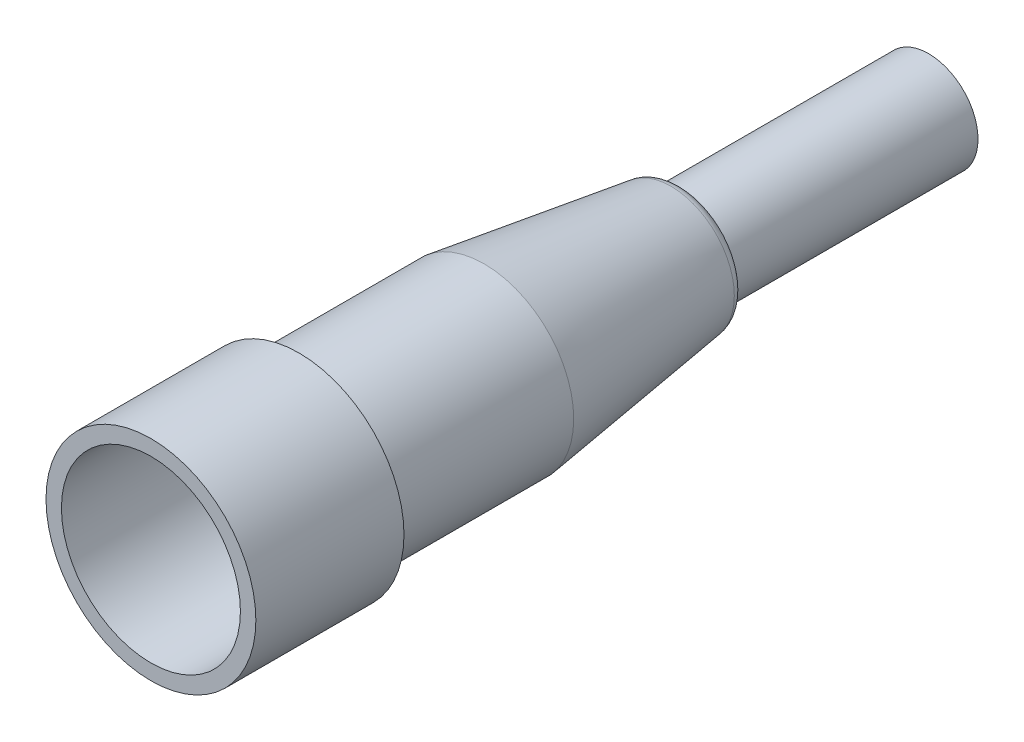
ISO-10303-21;
HEADER;
FILE_DESCRIPTION(('STEP AP214'),'2;1');
FILE_NAME('part.step','',(''),(''),'','','');
FILE_SCHEMA(('AUTOMOTIVE_DESIGN { 1 0 10303 214 1 1 1 1 }'));
ENDSEC;
DATA;
#1=APPLICATION_CONTEXT('core data for automotive mechanical design processes');
#2=APPLICATION_PROTOCOL_DEFINITION('international standard','automotive_design',2000,#1);
#3=PRODUCT_CONTEXT('',#1,'mechanical');
#4=PRODUCT('Part','Part','',(#3));
#5=PRODUCT_RELATED_PRODUCT_CATEGORY('part','',(#4));
#6=PRODUCT_DEFINITION_FORMATION('','',#4);
#7=PRODUCT_DEFINITION_CONTEXT('part definition',#1,'design');
#8=PRODUCT_DEFINITION('design','',#6,#7);
#9=PRODUCT_DEFINITION_SHAPE('','',#8);
#10=(LENGTH_UNIT() NAMED_UNIT(*) SI_UNIT(.MILLI.,.METRE.));
#11=(NAMED_UNIT(*) PLANE_ANGLE_UNIT() SI_UNIT($,.RADIAN.));
#12=(NAMED_UNIT(*) SI_UNIT($,.STERADIAN.) SOLID_ANGLE_UNIT());
#13=UNCERTAINTY_MEASURE_WITH_UNIT(LENGTH_MEASURE(1.E-05),#10,'distance_accuracy_value','');
#14=(GEOMETRIC_REPRESENTATION_CONTEXT(3) GLOBAL_UNCERTAINTY_ASSIGNED_CONTEXT((#13)) GLOBAL_UNIT_ASSIGNED_CONTEXT((#10,
#11,#12)) REPRESENTATION_CONTEXT('',''));
#15=CARTESIAN_POINT('',(0.,0.,0.));
#16=DIRECTION('',(0.,0.,1.));
#17=DIRECTION('',(1.,0.,0.));
#18=AXIS2_PLACEMENT_3D('',#15,#16,#17);
#19=CARTESIAN_POINT('',(0.,0.,28.));
#20=DIRECTION('',(0.,0.,-1.));
#21=DIRECTION('',(-1.,0.,0.));
#22=AXIS2_PLACEMENT_3D('',#19,#20,#21);
#23=CYLINDRICAL_SURFACE('',#22,8.5);
#24=CARTESIAN_POINT('',(0.,0.,28.));
#25=DIRECTION('',(0.,0.,1.));
#26=DIRECTION('',(1.,0.,0.));
#27=AXIS2_PLACEMENT_3D('',#24,#25,#26);
#28=CIRCLE('',#27,8.5);
#29=CARTESIAN_POINT('',(8.5,0.,28.));
#30=VERTEX_POINT('',#29);
#31=EDGE_CURVE('E11',#30,#30,#28,.T.);
#32=ORIENTED_EDGE('',*,*,#31,.F.);
#33=EDGE_LOOP('',(#32));
#34=FACE_BOUND('',#33,.T.);
#35=CARTESIAN_POINT('',(0.,0.,16.));
#36=DIRECTION('',(0.,0.,1.));
#37=DIRECTION('',(1.,0.,0.));
#38=AXIS2_PLACEMENT_3D('',#35,#36,#37);
#39=CIRCLE('',#38,8.5);
#40=CARTESIAN_POINT('',(8.5,0.,16.));
#41=VERTEX_POINT('',#40);
#42=EDGE_CURVE('E42',#41,#41,#39,.T.);
#43=ORIENTED_EDGE('',*,*,#42,.T.);
#44=EDGE_LOOP('',(#43));
#45=FACE_BOUND('',#44,.T.);
#46=ADVANCED_FACE('F36',(#34,#45),#23,.T.);
#47=CARTESIAN_POINT('',(0.,0.,28.));
#48=DIRECTION('',(0.,0.,1.));
#49=DIRECTION('',(1.,0.,0.));
#50=AXIS2_PLACEMENT_3D('',#47,#48,#49);
#51=PLANE('',#50);
#52=CARTESIAN_POINT('',(0.,0.,28.));
#53=DIRECTION('',(0.,0.,1.));
#54=DIRECTION('',(1.,0.,0.));
#55=AXIS2_PLACEMENT_3D('',#52,#53,#54);
#56=CIRCLE('',#55,7.25);
#57=CARTESIAN_POINT('',(7.25,0.,28.));
#58=VERTEX_POINT('',#57);
#59=EDGE_CURVE('E50',#58,#58,#56,.T.);
#60=ORIENTED_EDGE('',*,*,#59,.F.);
#61=EDGE_LOOP('',(#60));
#62=FACE_BOUND('',#61,.T.);
#63=ORIENTED_EDGE('',*,*,#31,.T.);
#64=EDGE_LOOP('',(#63));
#65=FACE_BOUND('',#64,.T.);
#66=ADVANCED_FACE('F58',(#62,#65),#51,.T.);
#67=CARTESIAN_POINT('',(0.,0.,16.));
#68=DIRECTION('',(0.,0.,1.));
#69=DIRECTION('',(1.,0.,0.));
#70=AXIS2_PLACEMENT_3D('',#67,#68,#69);
#71=PLANE('',#70);
#72=CARTESIAN_POINT('',(0.,0.,16.));
#73=DIRECTION('',(0.,0.,1.));
#74=DIRECTION('',(1.,0.,0.));
#75=AXIS2_PLACEMENT_3D('',#72,#73,#74);
#76=CIRCLE('',#75,7.25);
#77=CARTESIAN_POINT('',(7.25,0.,16.));
#78=VERTEX_POINT('',#77);
#79=EDGE_CURVE('E46',#78,#78,#76,.T.);
#80=ORIENTED_EDGE('',*,*,#79,.T.);
#81=EDGE_LOOP('',(#80));
#82=FACE_BOUND('',#81,.T.);
#83=ORIENTED_EDGE('',*,*,#42,.F.);
#84=EDGE_LOOP('',(#83));
#85=FACE_BOUND('',#84,.T.);
#86=ADVANCED_FACE('F60',(#82,#85),#71,.F.);
#87=CARTESIAN_POINT('',(0.,0.,16.));
#88=DIRECTION('',(0.,0.,1.));
#89=DIRECTION('',(1.,0.,0.));
#90=AXIS2_PLACEMENT_3D('',#87,#88,#89);
#91=CYLINDRICAL_SURFACE('',#90,7.25);
#92=ORIENTED_EDGE('',*,*,#79,.F.);
#93=EDGE_LOOP('',(#92));
#94=FACE_BOUND('',#93,.T.);
#95=ORIENTED_EDGE('',*,*,#59,.T.);
#96=EDGE_LOOP('',(#95));
#97=FACE_BOUND('',#96,.T.);
#98=ADVANCED_FACE('F56',(#94,#97),#91,.F.);
#99=CLOSED_SHELL('',(#46,#66,#86,#98));
#100=MANIFOLD_SOLID_BREP('B2',#99);
#101=CARTESIAN_POINT('',(0.,0.,-15.));
#102=DIRECTION('',(0.,0.,1.));
#103=DIRECTION('',(1.,0.,0.));
#104=AXIS2_PLACEMENT_3D('',#101,#102,#103);
#105=PLANE('',#104);
#106=CARTESIAN_POINT('',(0.,0.,-15.));
#107=DIRECTION('',(0.,0.,1.));
#108=DIRECTION('',(1.,0.,0.));
#109=AXIS2_PLACEMENT_3D('',#106,#107,#108);
#110=CIRCLE('',#109,4.13078571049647);
#111=CARTESIAN_POINT('',(4.13078571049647,0.,-15.));
#112=VERTEX_POINT('',#111);
#113=EDGE_CURVE('E104',#112,#112,#110,.F.);
#114=ORIENTED_EDGE('',*,*,#113,.T.);
#115=EDGE_LOOP('',(#114));
#116=FACE_BOUND('',#115,.T.);
#117=CARTESIAN_POINT('',(0.,0.,-15.));
#118=DIRECTION('',(0.,0.,1.));
#119=DIRECTION('',(1.,0.,0.));
#120=AXIS2_PLACEMENT_3D('',#117,#118,#119);
#121=CIRCLE('',#120,4.);
#122=CARTESIAN_POINT('',(4.,0.,-15.));
#123=VERTEX_POINT('',#122);
#124=EDGE_CURVE('E35',#123,#123,#121,.F.);
#125=ORIENTED_EDGE('',*,*,#124,.F.);
#126=EDGE_LOOP('',(#125));
#127=FACE_BOUND('',#126,.T.);
#128=ADVANCED_FACE('F97',(#116,#127),#105,.F.);
#129=CARTESIAN_POINT('',(0.,0.,15.));
#130=DIRECTION('',(0.,0.,-1.));
#131=DIRECTION('',(-1.,0.,0.));
#132=AXIS2_PLACEMENT_3D('',#129,#130,#131);
#133=CYLINDRICAL_SURFACE('',#132,7.25);
#134=CARTESIAN_POINT('',(0.,0.,1.));
#135=DIRECTION('',(0.,0.,1.));
#136=DIRECTION('',(1.,0.,0.));
#137=AXIS2_PLACEMENT_3D('',#134,#135,#136);
#138=CIRCLE('',#137,7.25);
#139=CARTESIAN_POINT('',(7.25,0.,1.));
#140=VERTEX_POINT('',#139);
#141=EDGE_CURVE('E117',#140,#140,#138,.T.);
#142=ORIENTED_EDGE('',*,*,#141,.T.);
#143=EDGE_LOOP('',(#142));
#144=FACE_BOUND('',#143,.T.);
#145=CARTESIAN_POINT('',(0.,0.,16.));
#146=DIRECTION('',(0.,0.,1.));
#147=DIRECTION('',(1.,0.,0.));
#148=AXIS2_PLACEMENT_3D('',#145,#146,#147);
#149=CIRCLE('',#148,7.25);
#150=CARTESIAN_POINT('',(7.25,0.,16.));
#151=VERTEX_POINT('',#150);
#152=EDGE_CURVE('E112',#151,#151,#149,.T.);
#153=ORIENTED_EDGE('',*,*,#152,.F.);
#154=EDGE_LOOP('',(#153));
#155=FACE_BOUND('',#154,.T.);
#156=ADVANCED_FACE('F99',(#144,#155),#133,.T.);
#157=CARTESIAN_POINT('',(0.,0.,16.));
#158=DIRECTION('',(0.,0.,1.));
#159=DIRECTION('',(1.,0.,0.));
#160=AXIS2_PLACEMENT_3D('',#157,#158,#159);
#161=PLANE('',#160);
#162=ORIENTED_EDGE('',*,*,#152,.T.);
#163=EDGE_LOOP('',(#162));
#164=FACE_BOUND('',#163,.T.);
#165=ADVANCED_FACE('F142',(#164),#161,.T.);
#166=CARTESIAN_POINT('',(0.,0.,-15.));
#167=DIRECTION('',(0.,0.,1.));
#168=DIRECTION('',(1.,0.,0.));
#169=AXIS2_PLACEMENT_3D('',#166,#167,#168);
#170=CONICAL_SURFACE('',#169,5.,0.139708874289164);
#171=CARTESIAN_POINT('',(0.,0.,-14.1392548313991));
#172=DIRECTION('',(0.,0.,-1.));
#173=DIRECTION('',(-1.,0.,0.));
#174=AXIS2_PLACEMENT_3D('',#171,#172,#173);
#175=CIRCLE('',#174,5.1210422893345);
#176=CARTESIAN_POINT('',(-5.1210422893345,0.,-14.1392548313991));
#177=VERTEX_POINT('',#176);
#178=EDGE_CURVE('E108',#177,#177,#175,.F.);
#179=ORIENTED_EDGE('',*,*,#178,.T.);
#180=EDGE_LOOP('',(#179));
#181=FACE_BOUND('',#180,.T.);
#182=ORIENTED_EDGE('',*,*,#141,.F.);
#183=EDGE_LOOP('',(#182));
#184=FACE_BOUND('',#183,.T.);
#185=ADVANCED_FACE('F135',(#181,#184),#170,.T.);
#186=CARTESIAN_POINT('',(0.,0.,-14.));
#187=DIRECTION('',(0.,0.,1.));
#188=DIRECTION('',(1.,0.,0.));
#189=AXIS2_PLACEMENT_3D('',#186,#187,#188);
#190=TOROIDAL_SURFACE('',#189,4.13078571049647,1.);
#191=ORIENTED_EDGE('',*,*,#113,.F.);
#192=EDGE_LOOP('',(#191));
#193=FACE_BOUND('',#192,.T.);
#194=ORIENTED_EDGE('',*,*,#178,.F.);
#195=EDGE_LOOP('',(#194));
#196=FACE_BOUND('',#195,.T.);
#197=ADVANCED_FACE('F128',(#193,#196),#190,.T.);
#198=CARTESIAN_POINT('',(0.,0.,-35.));
#199=DIRECTION('',(0.,0.,1.));
#200=DIRECTION('',(1.,0.,0.));
#201=AXIS2_PLACEMENT_3D('',#198,#199,#200);
#202=CYLINDRICAL_SURFACE('',#201,4.);
#203=CARTESIAN_POINT('',(0.,0.,-35.));
#204=DIRECTION('',(0.,0.,-1.));
#205=DIRECTION('',(-1.,0.,0.));
#206=AXIS2_PLACEMENT_3D('',#203,#204,#205);
#207=CIRCLE('',#206,4.);
#208=CARTESIAN_POINT('',(-4.,0.,-35.));
#209=VERTEX_POINT('',#208);
#210=EDGE_CURVE('E120',#209,#209,#207,.T.);
#211=ORIENTED_EDGE('',*,*,#210,.F.);
#212=EDGE_LOOP('',(#211));
#213=FACE_BOUND('',#212,.T.);
#214=ORIENTED_EDGE('',*,*,#124,.T.);
#215=EDGE_LOOP('',(#214));
#216=FACE_BOUND('',#215,.T.);
#217=ADVANCED_FACE('F126',(#213,#216),#202,.T.);
#218=CARTESIAN_POINT('',(0.,0.,-35.));
#219=DIRECTION('',(0.,0.,-1.));
#220=DIRECTION('',(-1.,0.,0.));
#221=AXIS2_PLACEMENT_3D('',#218,#219,#220);
#222=PLANE('',#221);
#223=ORIENTED_EDGE('',*,*,#210,.T.);
#224=EDGE_LOOP('',(#223));
#225=FACE_BOUND('',#224,.T.);
#226=ADVANCED_FACE('F124',(#225),#222,.T.);
#227=CLOSED_SHELL('',(#128,#156,#165,#185,#197,#217,#226));
#228=MANIFOLD_SOLID_BREP('B6',#227);
#229=ADVANCED_BREP_SHAPE_REPRESENTATION('',(#18,#100,#228),#14);
#230=SHAPE_DEFINITION_REPRESENTATION(#9,#229);
ENDSEC;
END-ISO-10303-21;
